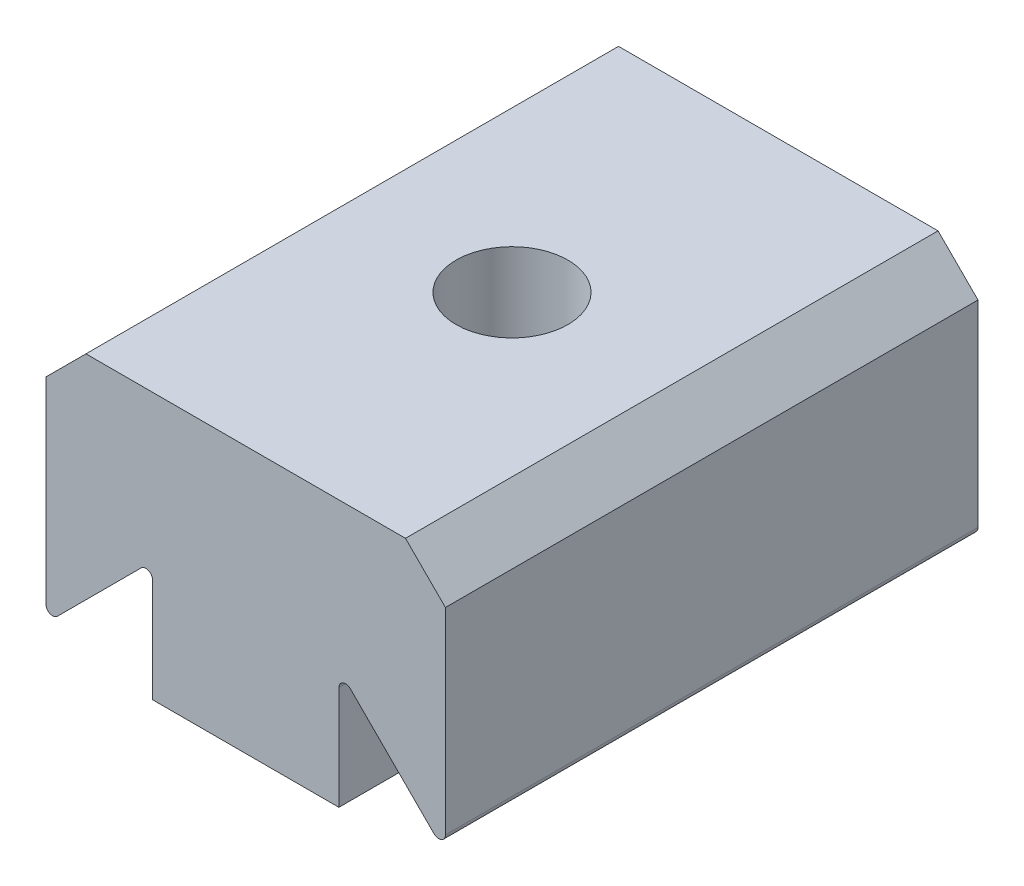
from build123d import *

# Parameters (mm, degrees)
ESQUISSE1_W             = 15
ESQUISSE1_H             = 10
EXTRUSION1_DEPTH        = 10
ENL_V_MAT_EXTRU_1_DEPTH = 35.974991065
CHANFREIN1_SIZE         = 1.5
TROU_TARAUD_M5X0_81_D   = 4.2


with BuildPart() as part:
    # Esquisse1 → Extrusion1 (new, symmetric)
    with BuildSketch(Plane.XY):
        with Locations((-3.5, 21.5)):
            Rectangle(ESQUISSE1_W, ESQUISSE1_H)
    extrude(amount=EXTRUSION1_DEPTH, both=True)

    # Esquisse3 → Enl_v. mat.-Extru.1 (cut, through all)
    with BuildSketch(Plane.XY.offset(10)):
        with BuildLine():
            Line((3.573223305, 17.426776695), (0.426776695, 20.573223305))
            ThreePointArc((0.426776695, 20.573223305), (0.154329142, 20.627416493), (0, 20.396446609))
            Line((0, 20.396446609), (0, 11.236942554))
            Line((0, 11.236942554), (9.983970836, 8.27222649))
            Line((9.983970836, 8.27222649), (14.338865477, 16.725437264))
            Line((14.338865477, 16.725437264), (4, 22.051776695))
            Line((4, 22.051776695), (4, 17.603553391))
            ThreePointArc((4, 17.603553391), (3.845670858, 17.372583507), (3.573223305, 17.426776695))
        make_face()
    enl_v_mat_extru_1 = extrude(amount=-ENL_V_MAT_EXTRU_1_DEPTH, mode=Mode.SUBTRACT)

    # Sym_trie1: Enl_v. mat.-Extru.1 across plane
    add(enl_v_mat_extru_1.mirror(Plane.ZY.offset(3.5)), mode=Mode.SUBTRACT)

    # Chanfrein1
    chanfrein1_edges = [part.edges().sort_by_distance(p)[0] for p in [
        (-11, 26.5, 0),
        (4, 26.5, 0),
    ]]
    chamfer(chanfrein1_edges, length=CHANFREIN1_SIZE)

    # Trou taraud_ M5x0.81 (through all)
    with Locations(Plane(origin=(0, 26.5, 0), x_dir=(-1, 0, 0), z_dir=(0, 1, 0))):
        with Locations((3.5, 0)):
            Hole(TROU_TARAUD_M5X0_81_D / 2)


solid = part.part
